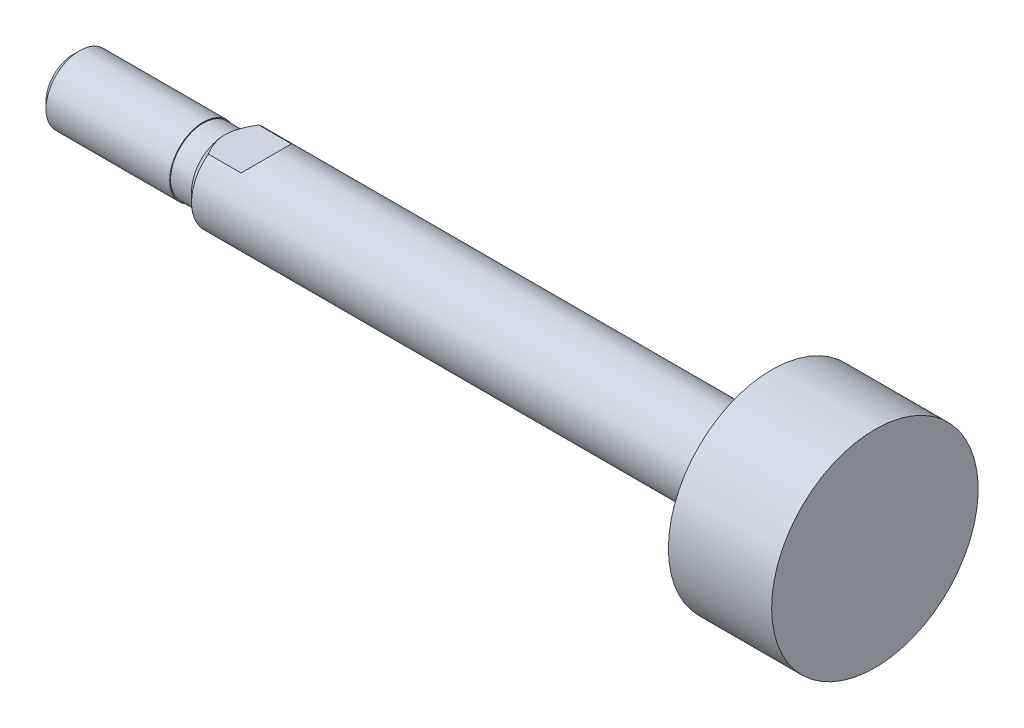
ISO-10303-21;
HEADER;
FILE_DESCRIPTION(('STEP AP214'),'2;1');
FILE_NAME('part.step','',(''),(''),'','','');
FILE_SCHEMA(('AUTOMOTIVE_DESIGN { 1 0 10303 214 1 1 1 1 }'));
ENDSEC;
DATA;
#1=APPLICATION_CONTEXT('core data for automotive mechanical design processes');
#2=APPLICATION_PROTOCOL_DEFINITION('international standard','automotive_design',2000,#1);
#3=PRODUCT_CONTEXT('',#1,'mechanical');
#4=PRODUCT('Part','Part','',(#3));
#5=PRODUCT_RELATED_PRODUCT_CATEGORY('part','',(#4));
#6=PRODUCT_DEFINITION_FORMATION('','',#4);
#7=PRODUCT_DEFINITION_CONTEXT('part definition',#1,'design');
#8=PRODUCT_DEFINITION('design','',#6,#7);
#9=PRODUCT_DEFINITION_SHAPE('','',#8);
#10=(LENGTH_UNIT() NAMED_UNIT(*) SI_UNIT(.MILLI.,.METRE.));
#11=(NAMED_UNIT(*) PLANE_ANGLE_UNIT() SI_UNIT($,.RADIAN.));
#12=(NAMED_UNIT(*) SI_UNIT($,.STERADIAN.) SOLID_ANGLE_UNIT());
#13=UNCERTAINTY_MEASURE_WITH_UNIT(LENGTH_MEASURE(1.E-05),#10,'distance_accuracy_value','');
#14=(GEOMETRIC_REPRESENTATION_CONTEXT(3) GLOBAL_UNCERTAINTY_ASSIGNED_CONTEXT((#13)) GLOBAL_UNIT_ASSIGNED_CONTEXT((#10,
#11,#12)) REPRESENTATION_CONTEXT('',''));
#15=CARTESIAN_POINT('',(0.,0.,0.));
#16=DIRECTION('',(0.,0.,1.));
#17=DIRECTION('',(1.,0.,0.));
#18=AXIS2_PLACEMENT_3D('',#15,#16,#17);
#19=CARTESIAN_POINT('',(-23.,0.,0.));
#20=DIRECTION('',(1.,0.,0.));
#21=DIRECTION('',(0.,0.,-1.));
#22=AXIS2_PLACEMENT_3D('',#19,#20,#21);
#23=PLANE('',#22);
#24=CARTESIAN_POINT('',(-23.,0.,0.));
#25=DIRECTION('',(-1.,0.,0.));
#26=DIRECTION('',(0.,0.,1.));
#27=AXIS2_PLACEMENT_3D('',#24,#25,#26);
#28=CIRCLE('',#27,3.233);
#29=CARTESIAN_POINT('',(-23.,0.,3.233));
#30=VERTEX_POINT('',#29);
#31=EDGE_CURVE('E61',#30,#30,#28,.T.);
#32=ORIENTED_EDGE('',*,*,#31,.T.);
#33=EDGE_LOOP('',(#32));
#34=FACE_BOUND('',#33,.T.);
#35=ADVANCED_FACE('F16',(#34),#23,.F.);
#36=CARTESIAN_POINT('',(-22.233,0.,0.));
#37=DIRECTION('',(1.,0.,0.));
#38=DIRECTION('',(0.,0.,-1.));
#39=AXIS2_PLACEMENT_3D('',#36,#37,#38);
#40=CONICAL_SURFACE('',#39,4.,0.785398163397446);
#41=ORIENTED_EDGE('',*,*,#31,.F.);
#42=EDGE_LOOP('',(#41));
#43=FACE_BOUND('',#42,.T.);
#44=CARTESIAN_POINT('',(-22.233,0.,0.));
#45=DIRECTION('',(-1.,0.,0.));
#46=DIRECTION('',(0.,0.,1.));
#47=AXIS2_PLACEMENT_3D('',#44,#45,#46);
#48=CIRCLE('',#47,4.);
#49=CARTESIAN_POINT('',(-22.233,0.,4.));
#50=VERTEX_POINT('',#49);
#51=EDGE_CURVE('E141',#50,#50,#48,.T.);
#52=ORIENTED_EDGE('',*,*,#51,.T.);
#53=EDGE_LOOP('',(#52));
#54=FACE_BOUND('',#53,.T.);
#55=ADVANCED_FACE('F131',(#43,#54),#40,.T.);
#56=CARTESIAN_POINT('',(72.5,0.,0.));
#57=DIRECTION('',(-1.,0.,0.));
#58=DIRECTION('',(0.,0.,1.));
#59=AXIS2_PLACEMENT_3D('',#56,#57,#58);
#60=CYLINDRICAL_SURFACE('',#59,4.);
#61=ORIENTED_EDGE('',*,*,#51,.F.);
#62=EDGE_LOOP('',(#61));
#63=FACE_BOUND('',#62,.T.);
#64=CARTESIAN_POINT('',(-7.5,0.,0.));
#65=DIRECTION('',(-1.,0.,0.));
#66=DIRECTION('',(0.,0.,1.));
#67=AXIS2_PLACEMENT_3D('',#64,#65,#66);
#68=CIRCLE('',#67,4.);
#69=CARTESIAN_POINT('',(-7.5,0.,4.));
#70=VERTEX_POINT('',#69);
#71=EDGE_CURVE('E144',#70,#70,#68,.T.);
#72=ORIENTED_EDGE('',*,*,#71,.T.);
#73=EDGE_LOOP('',(#72));
#74=FACE_BOUND('',#73,.T.);
#75=ADVANCED_FACE('F137',(#63,#74),#60,.T.);
#76=CARTESIAN_POINT('',(-7.5,4.,0.));
#77=DIRECTION('',(-1.,0.,0.));
#78=DIRECTION('',(0.,0.,1.));
#79=AXIS2_PLACEMENT_3D('',#76,#77,#78);
#80=PLANE('',#79);
#81=ORIENTED_EDGE('',*,*,#71,.F.);
#82=EDGE_LOOP('',(#81));
#83=FACE_BOUND('',#82,.T.);
#84=CARTESIAN_POINT('',(-7.5,0.,0.));
#85=DIRECTION('',(-1.,0.,0.));
#86=DIRECTION('',(0.,0.,1.));
#87=AXIS2_PLACEMENT_3D('',#84,#85,#86);
#88=CIRCLE('',#87,3.9);
#89=CARTESIAN_POINT('',(-7.5,0.,3.9));
#90=VERTEX_POINT('',#89);
#91=EDGE_CURVE('E149',#90,#90,#88,.T.);
#92=ORIENTED_EDGE('',*,*,#91,.T.);
#93=EDGE_LOOP('',(#92));
#94=FACE_BOUND('',#93,.T.);
#95=ADVANCED_FACE('F174',(#83,#94),#80,.F.);
#96=CARTESIAN_POINT('',(72.5,0.,0.));
#97=DIRECTION('',(-1.,0.,0.));
#98=DIRECTION('',(0.,0.,1.));
#99=AXIS2_PLACEMENT_3D('',#96,#97,#98);
#100=CYLINDRICAL_SURFACE('',#99,3.9);
#101=ORIENTED_EDGE('',*,*,#91,.F.);
#102=EDGE_LOOP('',(#101));
#103=FACE_BOUND('',#102,.T.);
#104=CARTESIAN_POINT('',(-5.,0.,0.));
#105=DIRECTION('',(-1.,0.,0.));
#106=DIRECTION('',(0.,0.,1.));
#107=AXIS2_PLACEMENT_3D('',#104,#105,#106);
#108=CIRCLE('',#107,3.9);
#109=CARTESIAN_POINT('',(-5.,0.,3.9));
#110=VERTEX_POINT('',#109);
#111=EDGE_CURVE('E152',#110,#110,#108,.T.);
#112=ORIENTED_EDGE('',*,*,#111,.T.);
#113=EDGE_LOOP('',(#112));
#114=FACE_BOUND('',#113,.T.);
#115=ADVANCED_FACE('F128',(#103,#114),#100,.T.);
#116=CARTESIAN_POINT('',(-3.9,0.,0.));
#117=DIRECTION('',(1.,0.,0.));
#118=DIRECTION('',(0.,0.,-1.));
#119=AXIS2_PLACEMENT_3D('',#116,#117,#118);
#120=CONICAL_SURFACE('',#119,5.,0.785398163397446);
#121=ORIENTED_EDGE('',*,*,#111,.F.);
#122=EDGE_LOOP('',(#121));
#123=FACE_BOUND('',#122,.T.);
#124=CARTESIAN_POINT('',(-3.9,0.,0.));
#125=DIRECTION('',(-1.,0.,0.));
#126=DIRECTION('',(0.,0.,1.));
#127=AXIS2_PLACEMENT_3D('',#124,#125,#126);
#128=CIRCLE('',#127,5.);
#129=CARTESIAN_POINT('',(-3.9,-4.,3.));
#130=VERTEX_POINT('',#129);
#131=CARTESIAN_POINT('',(-3.9,4.,3.));
#132=VERTEX_POINT('',#131);
#133=EDGE_CURVE('E72',#130,#132,#128,.T.);
#134=ORIENTED_EDGE('',*,*,#133,.T.);
#135=CARTESIAN_POINT('',(0.0592148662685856,4.,-8.01670325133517));
#136=CARTESIAN_POINT('',(-0.104734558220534,4.,-7.83345168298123));
#137=CARTESIAN_POINT('',(-0.268089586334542,4.,-7.64966351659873));
#138=CARTESIAN_POINT('',(-0.593295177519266,4.,-7.28073119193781));
#139=CARTESIAN_POINT('',(-0.755145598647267,4.,-7.09558690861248));
#140=CARTESIAN_POINT('',(-1.0776076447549,4.,-6.72298642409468));
#141=CARTESIAN_POINT('',(-1.23821221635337,4.,-6.53552410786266));
#142=CARTESIAN_POINT('',(-1.55707481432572,4.,-6.15862459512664));
#143=CARTESIAN_POINT('',(-1.71533293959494,4.,-5.96918748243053));
#144=CARTESIAN_POINT('',(-2.03813105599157,4.,-5.57660035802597));
#145=CARTESIAN_POINT('',(-2.20249013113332,4.,-5.37330116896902));
#146=CARTESIAN_POINT('',(-2.52679503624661,4.,-4.96321595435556));
#147=CARTESIAN_POINT('',(-2.68674111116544,4.,-4.75643012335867));
#148=CARTESIAN_POINT('',(-3.00041962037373,4.,-4.33867158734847));
#149=CARTESIAN_POINT('',(-3.15416117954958,4.,-4.12770576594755));
#150=CARTESIAN_POINT('',(-3.45331338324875,4.,-3.69997752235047));
#151=CARTESIAN_POINT('',(-3.59872661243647,4.,-3.48321692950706));
#152=CARTESIAN_POINT('',(-3.83936139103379,4.,-3.10248405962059));
#153=CARTESIAN_POINT('',(-3.93742116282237,4.,-2.94031515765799));
#154=CARTESIAN_POINT('',(-4.12514033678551,4.,-2.61105481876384));
#155=CARTESIAN_POINT('',(-4.214796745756,4.,-2.44396165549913));
#156=CARTESIAN_POINT('',(-4.38202517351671,4.,-2.10559748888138));
#157=CARTESIAN_POINT('',(-4.45969673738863,4.,-1.93437628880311));
#158=CARTESIAN_POINT('',(-4.60004030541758,4.,-1.58587891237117));
#159=CARTESIAN_POINT('',(-4.66272371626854,4.,-1.40860745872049));
#160=CARTESIAN_POINT('',(-4.74994261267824,4.,-1.11151605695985));
#161=CARTESIAN_POINT('',(-4.78014609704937,4.,-0.993362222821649));
#162=CARTESIAN_POINT('',(-4.83103250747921,4.,-0.755007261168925));
#163=CARTESIAN_POINT('',(-4.85171703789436,4.,-0.634806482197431));
#164=CARTESIAN_POINT('',(-4.88246398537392,4.,-0.393510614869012));
#165=CARTESIAN_POINT('',(-4.89256745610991,4.,-0.272420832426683));
#166=CARTESIAN_POINT('',(-4.901725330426,4.,-0.0298174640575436));
#167=CARTESIAN_POINT('',(-4.9007798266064,4.,0.0916961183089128));
#168=CARTESIAN_POINT('',(-4.88792304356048,4.,0.33360603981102));
#169=CARTESIAN_POINT('',(-4.87605905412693,4.,0.454004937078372));
#170=CARTESIAN_POINT('',(-4.84208274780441,4.,0.693353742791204));
#171=CARTESIAN_POINT('',(-4.81996803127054,4.,0.812303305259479));
#172=CARTESIAN_POINT('',(-4.76625038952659,4.,1.04947269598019));
#173=CARTESIAN_POINT('',(-4.73453978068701,4.,1.16766782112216));
#174=CARTESIAN_POINT('',(-4.66303307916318,4.,1.40153085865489));
#175=CARTESIAN_POINT('',(-4.62323841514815,4.,1.51719921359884));
#176=CARTESIAN_POINT('',(-4.52401503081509,4.,1.77992372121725));
#177=CARTESIAN_POINT('',(-4.46226527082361,4.,1.92609880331));
#178=CARTESIAN_POINT('',(-4.32977716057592,4.,2.21434798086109));
#179=CARTESIAN_POINT('',(-4.25903403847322,4.,2.35641984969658));
#180=CARTESIAN_POINT('',(-4.11029151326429,4.,2.63733832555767));
#181=CARTESIAN_POINT('',(-4.03226690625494,4.,2.77617148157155));
#182=CARTESIAN_POINT('',(-3.87072949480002,4.,3.05054974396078));
#183=CARTESIAN_POINT('',(-3.78721771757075,4.,3.18609545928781));
#184=CARTESIAN_POINT('',(-3.62008100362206,4.,3.447777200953));
#185=CARTESIAN_POINT('',(-3.53666511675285,4.,3.57404744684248));
#186=CARTESIAN_POINT('',(-3.36665654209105,4.,3.82443880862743));
#187=CARTESIAN_POINT('',(-3.28006360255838,4.,3.94855975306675));
#188=CARTESIAN_POINT('',(-3.1050645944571,4.,4.19387836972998));
#189=CARTESIAN_POINT('',(-3.01668096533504,4.,4.31509210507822));
#190=CARTESIAN_POINT('',(-2.83782414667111,4.,4.55591957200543));
#191=CARTESIAN_POINT('',(-2.74735152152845,4.,4.67553372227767));
#192=CARTESIAN_POINT('',(-2.65603372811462,4.,4.79448796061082));
#193=B_SPLINE_CURVE_WITH_KNOTS('',3,(#135,#136,#137,#138,#139,#140,#141,#142,#143,#144,#145,
#146,#147,#148,#149,#150,#151,#152,#153,#154,#155,#156,#157,#158,#159,#160,#161,#162,#163,#164,
#165,#166,#167,#168,#169,#170,#171,#172,#173,#174,#175,#176,#177,#178,#179,#180,#181,#182,#183,
#184,#185,#186,#187,#188,#189,#190,#191,#192),.UNSPECIFIED.,.F.,.F.,(4,2,2,2,2,2,2,2,2,2,2,2,2,
2,2,2,2,2,2,2,2,2,2,2,2,2,2,2,4),(0.,0.737665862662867,1.47540062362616,2.21594141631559,
2.95645090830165,3.74068924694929,4.52488396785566,5.3078799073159,6.09063151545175,
6.65898208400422,7.22753433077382,7.79107544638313,8.35418630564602,8.71971611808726,
9.08518430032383,9.44922918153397,9.8132710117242,10.1757434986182,10.5383008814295,
10.9050880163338,11.2718103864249,11.7474518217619,12.2233466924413,12.7009546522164,
13.1784734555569,13.6324221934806,14.0864069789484,14.5364269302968,14.9863266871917),.UNSPECIFIED.);
#194=CARTESIAN_POINT('',(-3.9,4.,-3.));
#195=VERTEX_POINT('',#194);
#196=EDGE_CURVE('E82',#132,#195,#193,.F.);
#197=ORIENTED_EDGE('',*,*,#196,.T.);
#198=CARTESIAN_POINT('',(-3.9,-4.,-3.));
#199=VERTEX_POINT('',#198);
#200=EDGE_CURVE('E155',#195,#199,#128,.T.);
#201=ORIENTED_EDGE('',*,*,#200,.T.);
#202=CARTESIAN_POINT('',(0.0592148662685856,-4.,-8.01670325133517));
#203=CARTESIAN_POINT('',(-0.104734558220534,-4.,-7.83345168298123));
#204=CARTESIAN_POINT('',(-0.268089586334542,-4.,-7.64966351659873));
#205=CARTESIAN_POINT('',(-0.593295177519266,-4.,-7.28073119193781));
#206=CARTESIAN_POINT('',(-0.755145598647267,-4.,-7.09558690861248));
#207=CARTESIAN_POINT('',(-1.0776076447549,-4.,-6.72298642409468));
#208=CARTESIAN_POINT('',(-1.23821221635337,-4.,-6.53552410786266));
#209=CARTESIAN_POINT('',(-1.55707481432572,-4.,-6.15862459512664));
#210=CARTESIAN_POINT('',(-1.71533293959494,-4.,-5.96918748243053));
#211=CARTESIAN_POINT('',(-2.03813105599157,-4.,-5.57660035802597));
#212=CARTESIAN_POINT('',(-2.20249013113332,-4.,-5.37330116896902));
#213=CARTESIAN_POINT('',(-2.52679503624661,-4.,-4.96321595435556));
#214=CARTESIAN_POINT('',(-2.68674111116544,-4.,-4.75643012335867));
#215=CARTESIAN_POINT('',(-3.00041962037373,-4.,-4.33867158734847));
#216=CARTESIAN_POINT('',(-3.15416117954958,-4.,-4.12770576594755));
#217=CARTESIAN_POINT('',(-3.45331338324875,-4.,-3.69997752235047));
#218=CARTESIAN_POINT('',(-3.59872661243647,-4.,-3.48321692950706));
#219=CARTESIAN_POINT('',(-3.83936139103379,-4.,-3.10248405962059));
#220=CARTESIAN_POINT('',(-3.93742116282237,-4.,-2.94031515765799));
#221=CARTESIAN_POINT('',(-4.12514033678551,-4.,-2.61105481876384));
#222=CARTESIAN_POINT('',(-4.214796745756,-4.,-2.44396165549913));
#223=CARTESIAN_POINT('',(-4.38202517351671,-4.,-2.10559748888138));
#224=CARTESIAN_POINT('',(-4.45969673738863,-4.,-1.93437628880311));
#225=CARTESIAN_POINT('',(-4.60004030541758,-4.,-1.58587891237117));
#226=CARTESIAN_POINT('',(-4.66272371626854,-4.,-1.40860745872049));
#227=CARTESIAN_POINT('',(-4.74994261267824,-4.,-1.11151605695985));
#228=CARTESIAN_POINT('',(-4.78014609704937,-4.,-0.993362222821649));
#229=CARTESIAN_POINT('',(-4.83103250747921,-4.,-0.755007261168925));
#230=CARTESIAN_POINT('',(-4.85171703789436,-4.,-0.634806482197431));
#231=CARTESIAN_POINT('',(-4.88246398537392,-4.,-0.393510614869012));
#232=CARTESIAN_POINT('',(-4.89256745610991,-4.,-0.272420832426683));
#233=CARTESIAN_POINT('',(-4.901725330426,-4.,-0.0298174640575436));
#234=CARTESIAN_POINT('',(-4.9007798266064,-4.,0.0916961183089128));
#235=CARTESIAN_POINT('',(-4.88792304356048,-4.,0.33360603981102));
#236=CARTESIAN_POINT('',(-4.87605905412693,-4.,0.454004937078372));
#237=CARTESIAN_POINT('',(-4.84208274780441,-4.,0.693353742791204));
#238=CARTESIAN_POINT('',(-4.81996803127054,-4.,0.812303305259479));
#239=CARTESIAN_POINT('',(-4.76625038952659,-4.,1.04947269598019));
#240=CARTESIAN_POINT('',(-4.73453978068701,-4.,1.16766782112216));
#241=CARTESIAN_POINT('',(-4.66303307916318,-4.,1.40153085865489));
#242=CARTESIAN_POINT('',(-4.62323841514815,-4.,1.51719921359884));
#243=CARTESIAN_POINT('',(-4.52401503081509,-4.,1.77992372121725));
#244=CARTESIAN_POINT('',(-4.46226527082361,-4.,1.92609880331));
#245=CARTESIAN_POINT('',(-4.32977716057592,-4.,2.21434798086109));
#246=CARTESIAN_POINT('',(-4.25903403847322,-4.,2.35641984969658));
#247=CARTESIAN_POINT('',(-4.11029151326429,-4.,2.63733832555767));
#248=CARTESIAN_POINT('',(-4.03226690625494,-4.,2.77617148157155));
#249=CARTESIAN_POINT('',(-3.87072949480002,-4.,3.05054974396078));
#250=CARTESIAN_POINT('',(-3.78721771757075,-4.,3.18609545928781));
#251=CARTESIAN_POINT('',(-3.62008100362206,-4.,3.447777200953));
#252=CARTESIAN_POINT('',(-3.53666511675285,-4.,3.57404744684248));
#253=CARTESIAN_POINT('',(-3.36665654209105,-4.,3.82443880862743));
#254=CARTESIAN_POINT('',(-3.28006360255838,-4.,3.94855975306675));
#255=CARTESIAN_POINT('',(-3.1050645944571,-4.,4.19387836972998));
#256=CARTESIAN_POINT('',(-3.01668096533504,-4.,4.31509210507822));
#257=CARTESIAN_POINT('',(-2.83782414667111,-4.,4.55591957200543));
#258=CARTESIAN_POINT('',(-2.74735152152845,-4.,4.67553372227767));
#259=CARTESIAN_POINT('',(-2.65603372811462,-4.,4.79448796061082));
#260=B_SPLINE_CURVE_WITH_KNOTS('',3,(#202,#203,#204,#205,#206,#207,#208,#209,#210,#211,#212,
#213,#214,#215,#216,#217,#218,#219,#220,#221,#222,#223,#224,#225,#226,#227,#228,#229,#230,#231,
#232,#233,#234,#235,#236,#237,#238,#239,#240,#241,#242,#243,#244,#245,#246,#247,#248,#249,#250,
#251,#252,#253,#254,#255,#256,#257,#258,#259),.UNSPECIFIED.,.F.,.F.,(4,2,2,2,2,2,2,2,2,2,2,2,2,
2,2,2,2,2,2,2,2,2,2,2,2,2,2,2,4),(0.,0.737665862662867,1.47540062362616,2.21594141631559,
2.95645090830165,3.74068924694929,4.52488396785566,5.3078799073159,6.09063151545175,
6.65898208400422,7.22753433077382,7.79107544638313,8.35418630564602,8.71971611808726,
9.08518430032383,9.44922918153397,9.8132710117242,10.1757434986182,10.5383008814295,
10.9050880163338,11.2718103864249,11.7474518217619,12.2233466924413,12.7009546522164,
13.1784734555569,13.6324221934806,14.0864069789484,14.5364269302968,14.9863266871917),.UNSPECIFIED.);
#261=EDGE_CURVE('E84',#199,#130,#260,.T.);
#262=ORIENTED_EDGE('',*,*,#261,.T.);
#263=EDGE_LOOP('',(#134,#197,#201,#262));
#264=FACE_BOUND('',#263,.T.);
#265=ADVANCED_FACE('F100',(#123,#264),#120,.T.);
#266=CARTESIAN_POINT('',(72.5,0.,0.));
#267=DIRECTION('',(-1.,0.,0.));
#268=DIRECTION('',(0.,0.,1.));
#269=AXIS2_PLACEMENT_3D('',#266,#267,#268);
#270=CYLINDRICAL_SURFACE('',#269,5.);
#271=CARTESIAN_POINT('',(-4.,0.,0.));
#272=DIRECTION('',(0.707106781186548,-0.707106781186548,0.));
#273=DIRECTION('',(-0.707106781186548,-0.707106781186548,0.));
#274=AXIS2_PLACEMENT_3D('',#271,#272,#273);
#275=ELLIPSE('',#274,7.07106781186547,5.);
#276=CARTESIAN_POINT('',(0.,4.,-3.));
#277=VERTEX_POINT('',#276);
#278=CARTESIAN_POINT('',(0.,4.,3.));
#279=VERTEX_POINT('',#278);
#280=EDGE_CURVE('E23',#277,#279,#275,.T.);
#281=ORIENTED_EDGE('',*,*,#280,.T.);
#282=DIRECTION('',(-1.,0.,0.));
#283=VECTOR('',#282,1.);
#284=CARTESIAN_POINT('',(72.5,4.,3.));
#285=LINE('',#284,#283);
#286=EDGE_CURVE('E11',#279,#132,#285,.T.);
#287=ORIENTED_EDGE('',*,*,#286,.T.);
#288=ORIENTED_EDGE('',*,*,#133,.F.);
#289=DIRECTION('',(-1.,0.,0.));
#290=VECTOR('',#289,1.);
#291=CARTESIAN_POINT('',(72.5,-4.,3.));
#292=LINE('',#291,#290);
#293=CARTESIAN_POINT('',(0.,-4.,3.));
#294=VERTEX_POINT('',#293);
#295=EDGE_CURVE('E65',#130,#294,#292,.F.);
#296=ORIENTED_EDGE('',*,*,#295,.T.);
#297=CARTESIAN_POINT('',(-4.,0.,0.));
#298=DIRECTION('',(0.707106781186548,0.707106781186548,0.));
#299=DIRECTION('',(-0.707106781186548,0.707106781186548,0.));
#300=AXIS2_PLACEMENT_3D('',#297,#298,#299);
#301=ELLIPSE('',#300,7.07106781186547,5.);
#302=CARTESIAN_POINT('',(0.,-4.,-3.));
#303=VERTEX_POINT('',#302);
#304=EDGE_CURVE('E55',#294,#303,#301,.T.);
#305=ORIENTED_EDGE('',*,*,#304,.T.);
#306=DIRECTION('',(-1.,0.,0.));
#307=VECTOR('',#306,1.);
#308=CARTESIAN_POINT('',(72.5,-4.,-3.));
#309=LINE('',#308,#307);
#310=EDGE_CURVE('E60',#303,#199,#309,.T.);
#311=ORIENTED_EDGE('',*,*,#310,.T.);
#312=ORIENTED_EDGE('',*,*,#200,.F.);
#313=DIRECTION('',(-1.,0.,0.));
#314=VECTOR('',#313,1.);
#315=CARTESIAN_POINT('',(72.5,4.,-3.));
#316=LINE('',#315,#314);
#317=EDGE_CURVE('E73',#195,#277,#316,.F.);
#318=ORIENTED_EDGE('',*,*,#317,.T.);
#319=EDGE_LOOP('',(#281,#287,#288,#296,#305,#311,#312,#318));
#320=FACE_BOUND('',#319,.T.);
#321=CARTESIAN_POINT('',(60.2,0.,0.));
#322=DIRECTION('',(-1.,0.,0.));
#323=DIRECTION('',(0.,0.,1.));
#324=AXIS2_PLACEMENT_3D('',#321,#322,#323);
#325=CIRCLE('',#324,5.);
#326=CARTESIAN_POINT('',(60.2,0.,5.));
#327=VERTEX_POINT('',#326);
#328=EDGE_CURVE('E157',#327,#327,#325,.T.);
#329=ORIENTED_EDGE('',*,*,#328,.T.);
#330=EDGE_LOOP('',(#329));
#331=FACE_BOUND('',#330,.T.);
#332=ADVANCED_FACE('F69',(#320,#331),#270,.T.);
#333=CARTESIAN_POINT('',(60.2,5.,0.));
#334=DIRECTION('',(1.,0.,0.));
#335=DIRECTION('',(0.,0.,-1.));
#336=AXIS2_PLACEMENT_3D('',#333,#334,#335);
#337=PLANE('',#336);
#338=ORIENTED_EDGE('',*,*,#328,.F.);
#339=EDGE_LOOP('',(#338));
#340=FACE_BOUND('',#339,.T.);
#341=CARTESIAN_POINT('',(60.2,0.,0.));
#342=DIRECTION('',(-1.,0.,0.));
#343=DIRECTION('',(0.,0.,1.));
#344=AXIS2_PLACEMENT_3D('',#341,#342,#343);
#345=CIRCLE('',#344,12.3);
#346=CARTESIAN_POINT('',(60.2,0.,12.3));
#347=VERTEX_POINT('',#346);
#348=EDGE_CURVE('E160',#347,#347,#345,.T.);
#349=ORIENTED_EDGE('',*,*,#348,.T.);
#350=EDGE_LOOP('',(#349));
#351=FACE_BOUND('',#350,.T.);
#352=ADVANCED_FACE('F118',(#340,#351),#337,.F.);
#353=CARTESIAN_POINT('',(72.5,0.,0.));
#354=DIRECTION('',(-1.,0.,0.));
#355=DIRECTION('',(0.,0.,1.));
#356=AXIS2_PLACEMENT_3D('',#353,#354,#355);
#357=CYLINDRICAL_SURFACE('',#356,12.3);
#358=ORIENTED_EDGE('',*,*,#348,.F.);
#359=EDGE_LOOP('',(#358));
#360=FACE_BOUND('',#359,.T.);
#361=CARTESIAN_POINT('',(72.5,0.,0.));
#362=DIRECTION('',(-1.,0.,0.));
#363=DIRECTION('',(0.,0.,1.));
#364=AXIS2_PLACEMENT_3D('',#361,#362,#363);
#365=CIRCLE('',#364,12.3);
#366=CARTESIAN_POINT('',(72.5,0.,12.3));
#367=VERTEX_POINT('',#366);
#368=EDGE_CURVE('E162',#367,#367,#365,.T.);
#369=ORIENTED_EDGE('',*,*,#368,.T.);
#370=EDGE_LOOP('',(#369));
#371=FACE_BOUND('',#370,.T.);
#372=ADVANCED_FACE('F114',(#360,#371),#357,.T.);
#373=CARTESIAN_POINT('',(72.5,12.3,0.));
#374=DIRECTION('',(-1.,0.,0.));
#375=DIRECTION('',(0.,0.,1.));
#376=AXIS2_PLACEMENT_3D('',#373,#374,#375);
#377=PLANE('',#376);
#378=ORIENTED_EDGE('',*,*,#368,.F.);
#379=EDGE_LOOP('',(#378));
#380=FACE_BOUND('',#379,.T.);
#381=ADVANCED_FACE('F111',(#380),#377,.F.);
#382=CARTESIAN_POINT('',(1.,-5.,-10.));
#383=DIRECTION('',(0.707106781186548,0.707106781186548,0.));
#384=DIRECTION('',(-0.707106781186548,0.707106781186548,0.));
#385=AXIS2_PLACEMENT_3D('',#382,#383,#384);
#386=PLANE('',#385);
#387=DIRECTION('',(0.,0.,1.));
#388=VECTOR('',#387,1.);
#389=CARTESIAN_POINT('',(0.,-4.,-10.));
#390=LINE('',#389,#388);
#391=EDGE_CURVE('E37',#303,#294,#390,.T.);
#392=ORIENTED_EDGE('',*,*,#391,.F.);
#393=ORIENTED_EDGE('',*,*,#304,.F.);
#394=EDGE_LOOP('',(#392,#393));
#395=FACE_BOUND('',#394,.T.);
#396=ADVANCED_FACE('F56',(#395),#386,.F.);
#397=CARTESIAN_POINT('',(0.,-4.,-10.));
#398=DIRECTION('',(0.,1.,0.));
#399=DIRECTION('',(0.,0.,1.));
#400=AXIS2_PLACEMENT_3D('',#397,#398,#399);
#401=PLANE('',#400);
#402=ORIENTED_EDGE('',*,*,#391,.T.);
#403=ORIENTED_EDGE('',*,*,#295,.F.);
#404=ORIENTED_EDGE('',*,*,#261,.F.);
#405=ORIENTED_EDGE('',*,*,#310,.F.);
#406=EDGE_LOOP('',(#402,#403,#404,#405));
#407=FACE_BOUND('',#406,.T.);
#408=ADVANCED_FACE('F64',(#407),#401,.F.);
#409=CARTESIAN_POINT('',(0.,4.,-10.));
#410=DIRECTION('',(0.707106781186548,-0.707106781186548,0.));
#411=DIRECTION('',(0.707106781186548,0.707106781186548,0.));
#412=AXIS2_PLACEMENT_3D('',#409,#410,#411);
#413=PLANE('',#412);
#414=DIRECTION('',(0.,0.,1.));
#415=VECTOR('',#414,1.);
#416=CARTESIAN_POINT('',(0.,4.,-10.));
#417=LINE('',#416,#415);
#418=EDGE_CURVE('E30',#277,#279,#417,.T.);
#419=ORIENTED_EDGE('',*,*,#418,.T.);
#420=ORIENTED_EDGE('',*,*,#280,.F.);
#421=EDGE_LOOP('',(#419,#420));
#422=FACE_BOUND('',#421,.T.);
#423=ADVANCED_FACE('F83',(#422),#413,.F.);
#424=CARTESIAN_POINT('',(-27.,4.,-10.));
#425=DIRECTION('',(0.,-1.,0.));
#426=DIRECTION('',(0.,0.,-1.));
#427=AXIS2_PLACEMENT_3D('',#424,#425,#426);
#428=PLANE('',#427);
#429=ORIENTED_EDGE('',*,*,#418,.F.);
#430=ORIENTED_EDGE('',*,*,#317,.F.);
#431=ORIENTED_EDGE('',*,*,#196,.F.);
#432=ORIENTED_EDGE('',*,*,#286,.F.);
#433=EDGE_LOOP('',(#429,#430,#431,#432));
#434=FACE_BOUND('',#433,.T.);
#435=ADVANCED_FACE('F80',(#434),#428,.F.);
#436=CLOSED_SHELL('',(#35,#55,#75,#95,#115,#265,#332,#352,#372,#381,#396,#408,#423,#435));
#437=MANIFOLD_SOLID_BREP('B1',#436);
#438=ADVANCED_BREP_SHAPE_REPRESENTATION('',(#18,#437),#14);
#439=SHAPE_DEFINITION_REPRESENTATION(#9,#438);
ENDSEC;
END-ISO-10303-21;
